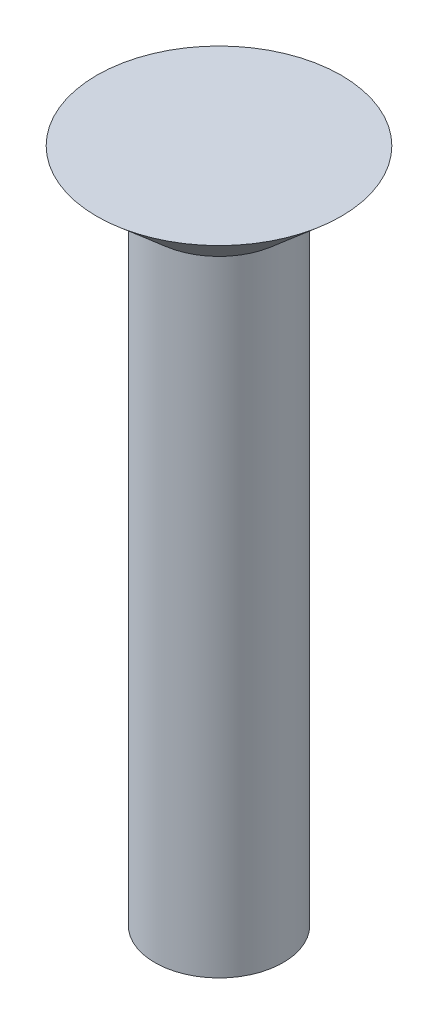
from build123d import *


with BuildPart() as part:
    # Sketch1 → Revolve1 (revolve)
    with BuildSketch(Plane.XY, mode=Mode.PRIVATE) as revolve1_sk:
        Polygon((0, 0), (4.5974, 0), (2.413, -1.89886995), (2.413, -25.4), (0, -25.4), align=None)
    revolve(revolve1_sk.sketch.rotate(Axis((0, 0, 0), (0, -1, 0)), 180), axis=Axis((0, 0, 0), (0, -1, 0)))


solid = part.part
